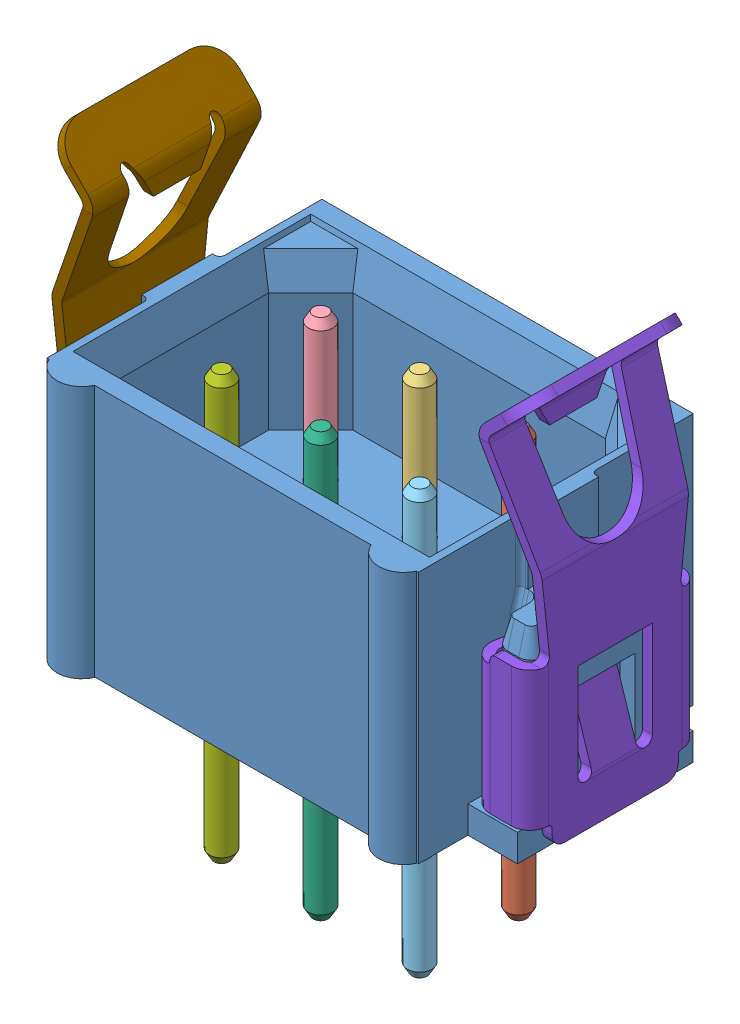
SolidWorks assembly m80-8530642_asm.SLDASM, configuration Default (file format 9000). Lengths in mm.
Overall size (9.9 11.7 5.85).
10 component instances, 9 part files, 0 mates.
Components (placement in the parent):
- M80-8690622-1: M80-8690622.sldasm [Default] at origin size (9.5 8.75 5.85)
  - M80-1020698-1: M80-1020698.sldprt [Default] at origin size (9.5 5.4 5.85)
  - M80-0200049-1: M80-0200049.sldprt [Default] at origin size (0.72 8.55 0.72)
  - M80-0200049_1-1: M80-0200049_1.sldprt [Default] at origin size (0.72 8.55 0.72)
  - M80-0200049_2-1: M80-0200049_2.sldprt [Default] at origin size (0.72 8.55 0.72)
  - M80-0200049_3-1: M80-0200049_3.sldprt [Default] at origin size (0.72 8.55 0.72)
  - M80-0200049_4-1: M80-0200049_4.sldprt [Default] at origin size (0.72 8.55 0.72)
  - M80-0200049_5-1: M80-0200049_5.sldprt [Default] at origin size (0.72 8.55 0.72)
- M80-001XXXX-1: M80-001XXXX.sldprt [Default] at origin size (1.2 7.95 3.45)
- M80-001XXXX_1-1: M80-001XXXX_1.sldprt [Default] at origin size (1.2 7.95 3.45)
